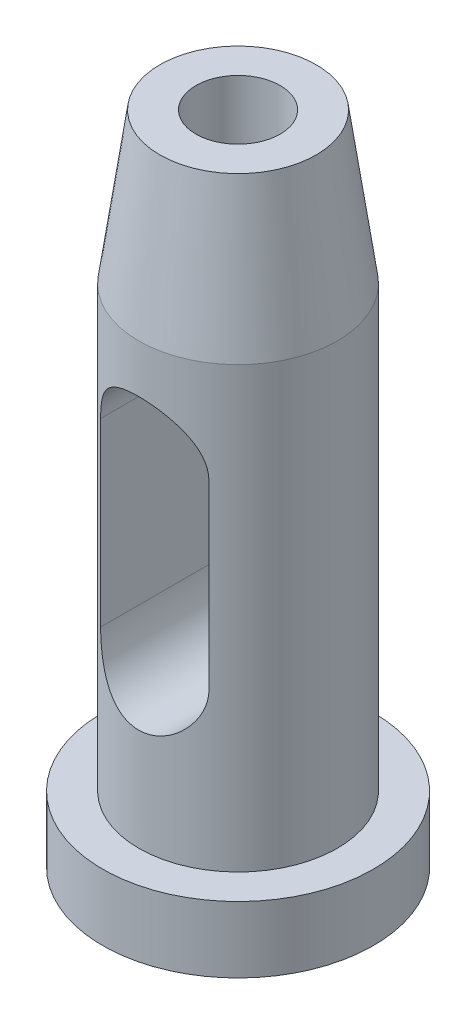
ISO-10303-21;
HEADER;
FILE_DESCRIPTION(('STEP AP214'),'2;1');
FILE_NAME('part.step','',(''),(''),'','','');
FILE_SCHEMA(('AUTOMOTIVE_DESIGN { 1 0 10303 214 1 1 1 1 }'));
ENDSEC;
DATA;
#1=APPLICATION_CONTEXT('core data for automotive mechanical design processes');
#2=APPLICATION_PROTOCOL_DEFINITION('international standard','automotive_design',2000,#1);
#3=PRODUCT_CONTEXT('',#1,'mechanical');
#4=PRODUCT('Part','Part','',(#3));
#5=PRODUCT_RELATED_PRODUCT_CATEGORY('part','',(#4));
#6=PRODUCT_DEFINITION_FORMATION('','',#4);
#7=PRODUCT_DEFINITION_CONTEXT('part definition',#1,'design');
#8=PRODUCT_DEFINITION('design','',#6,#7);
#9=PRODUCT_DEFINITION_SHAPE('','',#8);
#10=(LENGTH_UNIT() NAMED_UNIT(*) SI_UNIT(.MILLI.,.METRE.));
#11=(NAMED_UNIT(*) PLANE_ANGLE_UNIT() SI_UNIT($,.RADIAN.));
#12=(NAMED_UNIT(*) SI_UNIT($,.STERADIAN.) SOLID_ANGLE_UNIT());
#13=UNCERTAINTY_MEASURE_WITH_UNIT(LENGTH_MEASURE(1.E-05),#10,'distance_accuracy_value','');
#14=(GEOMETRIC_REPRESENTATION_CONTEXT(3) GLOBAL_UNCERTAINTY_ASSIGNED_CONTEXT((#13)) GLOBAL_UNIT_ASSIGNED_CONTEXT((#10,
#11,#12)) REPRESENTATION_CONTEXT('',''));
#15=CARTESIAN_POINT('',(0.,0.,0.));
#16=DIRECTION('',(0.,0.,1.));
#17=DIRECTION('',(1.,0.,0.));
#18=AXIS2_PLACEMENT_3D('',#15,#16,#17);
#19=CARTESIAN_POINT('',(0.,84.,0.));
#20=DIRECTION('',(0.,-1.,0.));
#21=DIRECTION('',(0.,0.,-1.));
#22=AXIS2_PLACEMENT_3D('',#19,#20,#21);
#23=CYLINDRICAL_SURFACE('',#22,22.5);
#24=CARTESIAN_POINT('',(0.,0.,0.));
#25=DIRECTION('',(0.,1.,0.));
#26=DIRECTION('',(0.,0.,1.));
#27=AXIS2_PLACEMENT_3D('',#24,#25,#26);
#28=CIRCLE('',#27,22.5);
#29=CARTESIAN_POINT('',(0.,0.,-22.5));
#30=VERTEX_POINT('',#29);
#31=EDGE_CURVE('E112',#30,#30,#28,.T.);
#32=CARTESIAN_POINT('',(0.,11.,0.));
#33=DIRECTION('',(0.,1.,0.));
#34=DIRECTION('',(0.,0.,1.));
#35=AXIS2_PLACEMENT_3D('',#32,#33,#34);
#36=CIRCLE('',#35,22.5);
#37=CARTESIAN_POINT('',(0.,11.,-22.5));
#38=VERTEX_POINT('',#37);
#39=EDGE_CURVE('E107',#38,#38,#36,.T.);
#40=CARTESIAN_POINT('',(0.,0.,-22.5));
#41=CARTESIAN_POINT('',(0.,0.114583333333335,-22.5));
#42=CARTESIAN_POINT('',(0.,0.229166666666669,-22.5));
#43=CARTESIAN_POINT('',(0.,0.458333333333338,-22.5));
#44=CARTESIAN_POINT('',(0.,0.572916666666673,-22.5));
#45=CARTESIAN_POINT('',(0.,0.802083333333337,-22.5));
#46=CARTESIAN_POINT('',(0.,0.916666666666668,-22.5));
#47=CARTESIAN_POINT('',(0.,1.14583333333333,-22.5));
#48=CARTESIAN_POINT('',(0.,1.26041666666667,-22.5));
#49=CARTESIAN_POINT('',(0.,1.48958333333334,-22.5));
#50=CARTESIAN_POINT('',(0.,1.60416666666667,-22.5));
#51=CARTESIAN_POINT('',(0.,1.83333333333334,-22.5));
#52=CARTESIAN_POINT('',(0.,1.94791666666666,-22.5));
#53=CARTESIAN_POINT('',(0.,2.17708333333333,-22.5));
#54=CARTESIAN_POINT('',(0.,2.29166666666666,-22.5));
#55=CARTESIAN_POINT('',(0.,2.52083333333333,-22.5));
#56=CARTESIAN_POINT('',(0.,2.63541666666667,-22.5));
#57=CARTESIAN_POINT('',(0.,2.86458333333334,-22.5));
#58=CARTESIAN_POINT('',(0.,2.97916666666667,-22.5));
#59=CARTESIAN_POINT('',(0.,3.20833333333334,-22.5));
#60=CARTESIAN_POINT('',(0.,3.32291666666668,-22.5));
#61=CARTESIAN_POINT('',(0.,3.55208333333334,-22.5));
#62=CARTESIAN_POINT('',(0.,3.66666666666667,-22.5));
#63=CARTESIAN_POINT('',(0.,3.89583333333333,-22.5));
#64=CARTESIAN_POINT('',(0.,4.01041666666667,-22.5));
#65=CARTESIAN_POINT('',(0.,4.23958333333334,-22.5));
#66=CARTESIAN_POINT('',(0.,4.35416666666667,-22.5));
#67=CARTESIAN_POINT('',(0.,4.58333333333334,-22.5));
#68=CARTESIAN_POINT('',(0.,4.69791666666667,-22.5));
#69=CARTESIAN_POINT('',(0.,4.92708333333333,-22.5));
#70=CARTESIAN_POINT('',(0.,5.04166666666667,-22.5));
#71=CARTESIAN_POINT('',(0.,5.27083333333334,-22.5));
#72=CARTESIAN_POINT('',(0.,5.38541666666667,-22.5));
#73=CARTESIAN_POINT('',(0.,5.61458333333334,-22.5));
#74=CARTESIAN_POINT('',(0.,5.72916666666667,-22.5));
#75=CARTESIAN_POINT('',(0.,5.95833333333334,-22.5));
#76=CARTESIAN_POINT('',(0.,6.07291666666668,-22.5));
#77=CARTESIAN_POINT('',(0.,6.30208333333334,-22.5));
#78=CARTESIAN_POINT('',(0.,6.41666666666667,-22.5));
#79=CARTESIAN_POINT('',(0.,6.64583333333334,-22.5));
#80=CARTESIAN_POINT('',(0.,6.76041666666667,-22.5));
#81=CARTESIAN_POINT('',(0.,6.98958333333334,-22.5));
#82=CARTESIAN_POINT('',(0.,7.10416666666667,-22.5));
#83=CARTESIAN_POINT('',(0.,7.33333333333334,-22.5));
#84=CARTESIAN_POINT('',(0.,7.44791666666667,-22.5));
#85=CARTESIAN_POINT('',(0.,7.67708333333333,-22.5));
#86=CARTESIAN_POINT('',(0.,7.79166666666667,-22.5));
#87=CARTESIAN_POINT('',(0.,8.02083333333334,-22.5));
#88=CARTESIAN_POINT('',(0.,8.13541666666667,-22.5));
#89=CARTESIAN_POINT('',(0.,8.36458333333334,-22.5));
#90=CARTESIAN_POINT('',(0.,8.47916666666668,-22.5));
#91=CARTESIAN_POINT('',(0.,8.70833333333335,-22.5));
#92=CARTESIAN_POINT('',(0.,8.82291666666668,-22.5));
#93=CARTESIAN_POINT('',(0.,9.05208333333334,-22.5));
#94=CARTESIAN_POINT('',(0.,9.16666666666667,-22.5));
#95=CARTESIAN_POINT('',(0.,9.39583333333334,-22.5));
#96=CARTESIAN_POINT('',(0.,9.51041666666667,-22.5));
#97=CARTESIAN_POINT('',(0.,9.73958333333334,-22.5));
#98=CARTESIAN_POINT('',(0.,9.85416666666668,-22.5));
#99=CARTESIAN_POINT('',(0.,10.0833333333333,-22.5));
#100=CARTESIAN_POINT('',(0.,10.1979166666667,-22.5));
#101=CARTESIAN_POINT('',(0.,10.4270833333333,-22.5));
#102=CARTESIAN_POINT('',(0.,10.5416666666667,-22.5));
#103=CARTESIAN_POINT('',(0.,10.7708333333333,-22.5));
#104=CARTESIAN_POINT('',(0.,10.8854166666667,-22.5));
#105=CARTESIAN_POINT('',(0.,11.,-22.5));
#106=B_SPLINE_CURVE_WITH_KNOTS('',3,(#40,#41,#42,#43,#44,#45,#46,#47,#48,#49,#50,#51,#52,#53,
#54,#55,#56,#57,#58,#59,#60,#61,#62,#63,#64,#65,#66,#67,#68,#69,#70,#71,#72,#73,#74,#75,#76,#77,
#78,#79,#80,#81,#82,#83,#84,#85,#86,#87,#88,#89,#90,#91,#92,#93,#94,#95,#96,#97,#98,#99,#100,
#101,#102,#103,#104,#105),.UNSPECIFIED.,.F.,.F.,(4,2,2,2,2,2,2,2,2,2,2,2,2,2,2,2,2,2,2,2,2,2,2,
2,2,2,2,2,2,2,2,2,4),(0.,0.343750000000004,0.687500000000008,1.03125,1.375,1.71875,
2.06249999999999,2.40625,2.75,3.09375000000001,3.43750000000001,3.78125,4.125,4.46875000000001,
4.8125,5.15625,5.50000000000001,5.84375000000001,6.18750000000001,6.53125,6.87500000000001,
7.21875000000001,7.5625,7.90625,8.25000000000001,8.59375000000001,8.93750000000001,
9.28125000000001,9.62500000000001,9.96875000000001,10.3125,10.65625,11.),.UNSPECIFIED.);
#107=EDGE_CURVE('BSEAM33',#30,#38,#106,.T.);
#108=ORIENTED_EDGE('',*,*,#31,.T.);
#109=ORIENTED_EDGE('',*,*,#39,.F.);
#110=ORIENTED_EDGE('',*,*,#107,.T.);
#111=ORIENTED_EDGE('',*,*,#107,.F.);
#112=EDGE_LOOP('',(#108,#110,#109,#111));
#113=FACE_BOUND('',#112,.T.);
#114=ADVANCED_FACE('F33',(#113),#23,.T.);
#115=CARTESIAN_POINT('',(0.,0.,0.));
#116=DIRECTION('',(0.,1.,0.));
#117=DIRECTION('',(0.,0.,1.));
#118=AXIS2_PLACEMENT_3D('',#115,#116,#117);
#119=PLANE('',#118);
#120=ORIENTED_EDGE('',*,*,#31,.F.);
#121=EDGE_LOOP('',(#120));
#122=FACE_BOUND('',#121,.T.);
#123=ADVANCED_FACE('F173',(#122),#119,.F.);
#124=CARTESIAN_POINT('',(0.,11.,0.));
#125=DIRECTION('',(0.,1.,0.));
#126=DIRECTION('',(0.,0.,1.));
#127=AXIS2_PLACEMENT_3D('',#124,#125,#126);
#128=PLANE('',#127);
#129=CARTESIAN_POINT('',(0.,11.,0.));
#130=DIRECTION('',(0.,1.,0.));
#131=DIRECTION('',(0.,0.,1.));
#132=AXIS2_PLACEMENT_3D('',#129,#130,#131);
#133=CIRCLE('',#132,16.5);
#134=CARTESIAN_POINT('',(0.,11.,16.5));
#135=VERTEX_POINT('',#134);
#136=EDGE_CURVE('E104',#135,#135,#133,.T.);
#137=ORIENTED_EDGE('',*,*,#136,.F.);
#138=EDGE_LOOP('',(#137));
#139=FACE_BOUND('',#138,.T.);
#140=ORIENTED_EDGE('',*,*,#39,.T.);
#141=EDGE_LOOP('',(#140));
#142=FACE_BOUND('',#141,.T.);
#143=ADVANCED_FACE('F171',(#139,#142),#128,.T.);
#144=CARTESIAN_POINT('',(0.,11.,0.));
#145=DIRECTION('',(0.,1.,0.));
#146=DIRECTION('',(0.,0.,1.));
#147=AXIS2_PLACEMENT_3D('',#144,#145,#146);
#148=CYLINDRICAL_SURFACE('',#147,16.5);
#149=CARTESIAN_POINT('',(9.,37.,-13.8293166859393));
#150=CARTESIAN_POINT('',(9.00000108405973,36.883879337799,-13.8293134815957));
#151=CARTESIAN_POINT('',(8.99775214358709,36.767775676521,-13.8307798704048));
#152=CARTESIAN_POINT('',(8.98877121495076,36.535821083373,-13.8366193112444));
#153=CARTESIAN_POINT('',(8.98203946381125,36.4199701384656,-13.8409922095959));
#154=CARTESIAN_POINT('',(8.95516299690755,36.0733363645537,-13.8584105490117));
#155=CARTESIAN_POINT('',(8.92833699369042,35.8432404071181,-13.8757557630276));
#156=CARTESIAN_POINT('',(8.85750818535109,35.3884183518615,-13.9210734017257));
#157=CARTESIAN_POINT('',(8.8136216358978,35.1636666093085,-13.948973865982));
#158=CARTESIAN_POINT('',(8.70925748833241,34.7194526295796,-14.0143719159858));
#159=CARTESIAN_POINT('',(8.64877742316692,34.4999911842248,-14.051870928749));
#160=CARTESIAN_POINT('',(8.51214530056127,34.0683671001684,-14.1350539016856));
#161=CARTESIAN_POINT('',(8.43604118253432,33.8561843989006,-14.1807127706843));
#162=CARTESIAN_POINT('',(8.26878667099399,33.4394344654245,-14.2788853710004));
#163=CARTESIAN_POINT('',(8.17763046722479,33.2348702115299,-14.3314017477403));
#164=CARTESIAN_POINT('',(7.88243166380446,32.6334424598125,-14.4971809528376));
#165=CARTESIAN_POINT('',(7.65678284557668,32.2492309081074,-14.6185947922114));
#166=CARTESIAN_POINT('',(7.12849041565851,31.4844351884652,-14.8838866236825));
#167=CARTESIAN_POINT('',(6.82045172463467,31.107936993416,-15.0287993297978));
#168=CARTESIAN_POINT('',(6.31599281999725,30.5838378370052,-15.2444045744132));
#169=CARTESIAN_POINT('',(6.1406750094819,30.4158391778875,-15.3160142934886));
#170=CARTESIAN_POINT('',(5.77646350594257,30.0940974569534,-15.4570552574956));
#171=CARTESIAN_POINT('',(5.58756768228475,29.9403566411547,-15.5264861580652));
#172=CARTESIAN_POINT('',(5.18051796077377,29.6357479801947,-15.6672413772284));
#173=CARTESIAN_POINT('',(4.96124072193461,29.4862228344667,-15.7382291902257));
#174=CARTESIAN_POINT('',(4.50895648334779,29.2064140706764,-15.8737205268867));
#175=CARTESIAN_POINT('',(4.27595550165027,29.0761221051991,-15.9382268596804));
#176=CARTESIAN_POINT('',(3.79761413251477,28.8360727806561,-16.058921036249));
#177=CARTESIAN_POINT('',(3.55227747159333,28.726309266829,-16.1151113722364));
#178=CARTESIAN_POINT('',(3.05094857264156,28.5286196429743,-16.2174945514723));
#179=CARTESIAN_POINT('',(2.79495773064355,28.4406906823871,-16.2636886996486));
#180=CARTESIAN_POINT('',(2.29578601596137,28.2941761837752,-16.3412924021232));
#181=CARTESIAN_POINT('',(2.05327784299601,28.2337747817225,-16.3736041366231));
#182=CARTESIAN_POINT('',(1.56293437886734,28.1332161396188,-16.4276612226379));
#183=CARTESIAN_POINT('',(1.31509935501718,28.0930578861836,-16.4494071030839));
#184=CARTESIAN_POINT('',(0.816366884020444,28.0335861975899,-16.4816853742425));
#185=CARTESIAN_POINT('',(0.565471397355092,28.0142600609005,-16.4922245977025));
#186=CARTESIAN_POINT('',(0.0627317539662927,27.9967054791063,-16.5017954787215));
#187=CARTESIAN_POINT('',(-0.189112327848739,27.9984754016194,-16.50082802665));
#188=CARTESIAN_POINT('',(-0.665502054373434,28.0218053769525,-16.4881140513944));
#189=CARTESIAN_POINT('',(-0.890182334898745,28.0413039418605,-16.4774903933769));
#190=CARTESIAN_POINT('',(-1.33685629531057,28.0969968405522,-16.4472768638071));
#191=CARTESIAN_POINT('',(-1.55884996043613,28.1331912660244,-16.4276869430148));
#192=CARTESIAN_POINT('',(-1.99861633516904,28.2218538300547,-16.380001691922));
#193=CARTESIAN_POINT('',(-2.21638915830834,28.274321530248,-16.3519065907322));
#194=CARTESIAN_POINT('',(-2.64635039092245,28.3949611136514,-16.287850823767));
#195=CARTESIAN_POINT('',(-2.85853858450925,28.4631336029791,-16.2518898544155));
#196=CARTESIAN_POINT('',(-3.27839087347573,28.6153386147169,-16.1724544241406));
#197=CARTESIAN_POINT('',(-3.48598071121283,28.6995354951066,-16.1289025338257));
#198=CARTESIAN_POINT('',(-3.89317238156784,28.882544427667,-16.0354892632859));
#199=CARTESIAN_POINT('',(-4.09277155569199,28.9813612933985,-15.9856258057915));
#200=CARTESIAN_POINT('',(-4.6780854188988,29.2985524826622,-15.8280900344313));
#201=CARTESIAN_POINT('',(-5.05057142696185,29.5377607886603,-15.7124221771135));
#202=CARTESIAN_POINT('',(-5.79155336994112,30.0938519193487,-15.4556692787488));
#203=CARTESIAN_POINT('',(-6.15539162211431,30.416296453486,-15.3131891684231));
#204=CARTESIAN_POINT('',(-6.65848604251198,30.9400196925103,-15.0979492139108));
#205=CARTESIAN_POINT('',(-6.81920359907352,31.1214581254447,-15.0258813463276));
#206=CARTESIAN_POINT('',(-7.12576361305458,31.4970705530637,-14.8829449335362));
#207=CARTESIAN_POINT('',(-7.27160350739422,31.6912467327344,-14.8120765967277));
#208=CARTESIAN_POINT('',(-7.55952537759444,32.1088482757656,-14.667370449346));
#209=CARTESIAN_POINT('',(-7.70018681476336,32.3333501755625,-14.593807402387));
#210=CARTESIAN_POINT('',(-7.96181155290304,32.7952459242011,-14.4527381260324));
#211=CARTESIAN_POINT('',(-8.08278383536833,33.0326338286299,-14.3852291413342));
#212=CARTESIAN_POINT('',(-8.3036590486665,33.5185749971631,-14.2588712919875));
#213=CARTESIAN_POINT('',(-8.40360853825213,33.76710207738,-14.2000033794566));
#214=CARTESIAN_POINT('',(-8.58148374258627,34.2741530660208,-14.0932226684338));
#215=CARTESIAN_POINT('',(-8.65941860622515,34.5326727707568,-14.0453053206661));
#216=CARTESIAN_POINT('',(-8.7708010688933,34.9734488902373,-13.9759024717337));
#217=CARTESIAN_POINT('',(-8.81050140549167,35.1535934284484,-13.9508676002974));
#218=CARTESIAN_POINT('',(-8.87885237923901,35.5167275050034,-13.9074662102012));
#219=CARTESIAN_POINT('',(-8.90750616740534,35.6997162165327,-13.8890977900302));
#220=CARTESIAN_POINT('',(-8.95358220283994,36.0683513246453,-13.8594431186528));
#221=CARTESIAN_POINT('',(-8.97096345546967,36.2540049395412,-13.8481827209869));
#222=CARTESIAN_POINT('',(-8.99418564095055,36.6264335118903,-13.8331000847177));
#223=CARTESIAN_POINT('',(-9.00002022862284,36.8132090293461,-13.8292819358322));
#224=CARTESIAN_POINT('',(-9.,37.,-13.8293166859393));
#225=B_SPLINE_CURVE_WITH_KNOTS('',3,(#149,#150,#151,#152,#153,#154,#155,#156,#157,#158,#159,
#160,#161,#162,#163,#164,#165,#166,#167,#168,#169,#170,#171,#172,#173,#174,#175,#176,#177,#178,
#179,#180,#181,#182,#183,#184,#185,#186,#187,#188,#189,#190,#191,#192,#193,#194,#195,#196,#197,
#198,#199,#200,#201,#202,#203,#204,#205,#206,#207,#208,#209,#210,#211,#212,#213,#214,#215,#216,
#217,#218,#219,#220,#221,#222,#223,#224),.UNSPECIFIED.,.F.,.F.,(4,2,2,2,2,2,2,2,2,2,2,2,2,2,2,2,
2,2,2,2,2,2,2,2,2,2,2,2,2,2,2,2,2,2,2,2,2,4),(0.,0.348297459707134,0.696576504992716,
1.3924406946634,2.08364390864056,2.77494994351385,3.46416571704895,4.15364815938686,
5.53384137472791,7.05000030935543,7.80883706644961,8.56779315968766,9.39093850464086,
10.2137255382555,11.0362654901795,11.8586980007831,12.6136393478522,13.3685428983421,
14.1229859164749,14.8773705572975,15.5538916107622,16.2304163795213,16.9069229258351,
17.5834555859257,18.2673428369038,18.9514557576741,20.3188620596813,21.8320268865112,
22.5900243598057,23.348152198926,24.1719696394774,24.9954102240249,25.8170074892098,
26.6382628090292,27.1963145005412,27.7542068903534,28.3141169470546,28.8743346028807),.UNSPECIFIED.);
#226=CARTESIAN_POINT('',(9.,37.,-13.8293166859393));
#227=VERTEX_POINT('',#226);
#228=CARTESIAN_POINT('',(-9.,37.,-13.8293166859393));
#229=VERTEX_POINT('',#228);
#230=EDGE_CURVE('E11',#227,#229,#225,.T.);
#231=ORIENTED_EDGE('',*,*,#230,.F.);
#232=DIRECTION('',(0.,1.,0.));
#233=VECTOR('',#232,1.);
#234=CARTESIAN_POINT('',(9.,11.,-13.8293166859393));
#235=LINE('',#234,#233);
#236=CARTESIAN_POINT('',(9.,67.,-13.8293166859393));
#237=VERTEX_POINT('',#236);
#238=EDGE_CURVE('E144',#237,#227,#235,.F.);
#239=ORIENTED_EDGE('',*,*,#238,.F.);
#240=CARTESIAN_POINT('',(-9.,67.,-13.8293166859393));
#241=CARTESIAN_POINT('',(-9.00000108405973,67.116120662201,-13.8293134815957));
#242=CARTESIAN_POINT('',(-8.99775214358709,67.232224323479,-13.8307798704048));
#243=CARTESIAN_POINT('',(-8.98877121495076,67.464178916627,-13.8366193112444));
#244=CARTESIAN_POINT('',(-8.98203946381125,67.5800298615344,-13.8409922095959));
#245=CARTESIAN_POINT('',(-8.95516299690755,67.9266636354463,-13.8584105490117));
#246=CARTESIAN_POINT('',(-8.92833699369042,68.1567595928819,-13.8757557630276));
#247=CARTESIAN_POINT('',(-8.85750818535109,68.6115816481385,-13.9210734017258));
#248=CARTESIAN_POINT('',(-8.8136216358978,68.8363333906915,-13.948973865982));
#249=CARTESIAN_POINT('',(-8.70925748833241,69.2805473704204,-14.0143719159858));
#250=CARTESIAN_POINT('',(-8.64877742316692,69.5000088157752,-14.051870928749));
#251=CARTESIAN_POINT('',(-8.51214530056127,69.9316328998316,-14.1350539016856));
#252=CARTESIAN_POINT('',(-8.43604118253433,70.1438156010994,-14.1807127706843));
#253=CARTESIAN_POINT('',(-8.268786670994,70.5605655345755,-14.2788853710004));
#254=CARTESIAN_POINT('',(-8.1776304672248,70.7651297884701,-14.3314017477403));
#255=CARTESIAN_POINT('',(-7.88243166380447,71.3665575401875,-14.4971809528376));
#256=CARTESIAN_POINT('',(-7.65678284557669,71.7507690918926,-14.6185947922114));
#257=CARTESIAN_POINT('',(-7.12849041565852,72.5155648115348,-14.8838866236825));
#258=CARTESIAN_POINT('',(-6.82045172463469,72.892063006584,-15.0287993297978));
#259=CARTESIAN_POINT('',(-6.31599281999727,73.4161621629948,-15.2444045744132));
#260=CARTESIAN_POINT('',(-6.14067500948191,73.5841608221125,-15.3160142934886));
#261=CARTESIAN_POINT('',(-5.77646350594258,73.9059025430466,-15.4570552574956));
#262=CARTESIAN_POINT('',(-5.58756768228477,74.0596433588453,-15.5264861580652));
#263=CARTESIAN_POINT('',(-5.18051796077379,74.3642520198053,-15.6672413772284));
#264=CARTESIAN_POINT('',(-4.96124072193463,74.5137771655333,-15.7382291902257));
#265=CARTESIAN_POINT('',(-4.50895648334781,74.7935859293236,-15.8737205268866));
#266=CARTESIAN_POINT('',(-4.27595550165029,74.9238778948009,-15.9382268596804));
#267=CARTESIAN_POINT('',(-3.79761413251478,75.1639272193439,-16.058921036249));
#268=CARTESIAN_POINT('',(-3.55227747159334,75.273690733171,-16.1151113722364));
#269=CARTESIAN_POINT('',(-3.05094857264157,75.4713803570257,-16.2174945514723));
#270=CARTESIAN_POINT('',(-2.79495773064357,75.5593093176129,-16.2636886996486));
#271=CARTESIAN_POINT('',(-2.29578601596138,75.7058238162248,-16.3412924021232));
#272=CARTESIAN_POINT('',(-2.05327784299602,75.7662252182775,-16.3736041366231));
#273=CARTESIAN_POINT('',(-1.56293437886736,75.8667838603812,-16.4276612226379));
#274=CARTESIAN_POINT('',(-1.3150993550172,75.9069421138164,-16.4494071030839));
#275=CARTESIAN_POINT('',(-0.816366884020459,75.9664138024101,-16.4816853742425));
#276=CARTESIAN_POINT('',(-0.565471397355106,75.9857399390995,-16.4922245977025));
#277=CARTESIAN_POINT('',(-0.0627317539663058,76.0032945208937,-16.5017954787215));
#278=CARTESIAN_POINT('',(0.189112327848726,76.0015245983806,-16.50082802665));
#279=CARTESIAN_POINT('',(0.665502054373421,75.9781946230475,-16.4881140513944));
#280=CARTESIAN_POINT('',(0.890182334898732,75.9586960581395,-16.4774903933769));
#281=CARTESIAN_POINT('',(1.33685629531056,75.9030031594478,-16.4472768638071));
#282=CARTESIAN_POINT('',(1.55884996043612,75.8668087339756,-16.4276869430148));
#283=CARTESIAN_POINT('',(1.99861633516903,75.7781461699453,-16.380001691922));
#284=CARTESIAN_POINT('',(2.21638915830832,75.725678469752,-16.3519065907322));
#285=CARTESIAN_POINT('',(2.64635039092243,75.6050388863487,-16.287850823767));
#286=CARTESIAN_POINT('',(2.85853858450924,75.5368663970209,-16.2518898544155));
#287=CARTESIAN_POINT('',(3.27839087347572,75.3846613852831,-16.1724544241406));
#288=CARTESIAN_POINT('',(3.48598071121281,75.3004645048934,-16.1289025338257));
#289=CARTESIAN_POINT('',(3.89317238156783,75.117455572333,-16.0354892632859));
#290=CARTESIAN_POINT('',(4.09277155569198,75.0186387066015,-15.9856258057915));
#291=CARTESIAN_POINT('',(4.67808541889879,74.7014475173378,-15.8280900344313));
#292=CARTESIAN_POINT('',(5.05057142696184,74.4622392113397,-15.7124221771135));
#293=CARTESIAN_POINT('',(5.7915533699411,73.9061480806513,-15.4556692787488));
#294=CARTESIAN_POINT('',(6.1553916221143,73.5837035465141,-15.3131891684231));
#295=CARTESIAN_POINT('',(6.65848604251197,73.0599803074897,-15.0979492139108));
#296=CARTESIAN_POINT('',(6.81920359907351,72.8785418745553,-15.0258813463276));
#297=CARTESIAN_POINT('',(7.12576361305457,72.5029294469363,-14.8829449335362));
#298=CARTESIAN_POINT('',(7.27160350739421,72.3087532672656,-14.8120765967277));
#299=CARTESIAN_POINT('',(7.55952537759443,71.8911517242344,-14.667370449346));
#300=CARTESIAN_POINT('',(7.70018681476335,71.6666498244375,-14.593807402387));
#301=CARTESIAN_POINT('',(7.96181155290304,71.2047540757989,-14.4527381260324));
#302=CARTESIAN_POINT('',(8.08278383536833,70.9673661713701,-14.3852291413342));
#303=CARTESIAN_POINT('',(8.30365904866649,70.4814250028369,-14.2588712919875));
#304=CARTESIAN_POINT('',(8.40360853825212,70.23289792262,-14.2000033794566));
#305=CARTESIAN_POINT('',(8.58148374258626,69.7258469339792,-14.0932226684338));
#306=CARTESIAN_POINT('',(8.65941860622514,69.4673272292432,-14.0453053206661));
#307=CARTESIAN_POINT('',(8.7708010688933,69.0265511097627,-13.9759024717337));
#308=CARTESIAN_POINT('',(8.81050140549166,68.8464065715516,-13.9508676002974));
#309=CARTESIAN_POINT('',(8.87885237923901,68.4832724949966,-13.9074662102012));
#310=CARTESIAN_POINT('',(8.90750616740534,68.3002837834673,-13.8890977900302));
#311=CARTESIAN_POINT('',(8.95358220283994,67.9316486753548,-13.8594431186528));
#312=CARTESIAN_POINT('',(8.97096345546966,67.7459950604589,-13.8481827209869));
#313=CARTESIAN_POINT('',(8.99418564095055,67.3735664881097,-13.8331000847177));
#314=CARTESIAN_POINT('',(9.00002022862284,67.186790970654,-13.8292819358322));
#315=CARTESIAN_POINT('',(9.,67.,-13.8293166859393));
#316=B_SPLINE_CURVE_WITH_KNOTS('',3,(#240,#241,#242,#243,#244,#245,#246,#247,#248,#249,#250,
#251,#252,#253,#254,#255,#256,#257,#258,#259,#260,#261,#262,#263,#264,#265,#266,#267,#268,#269,
#270,#271,#272,#273,#274,#275,#276,#277,#278,#279,#280,#281,#282,#283,#284,#285,#286,#287,#288,
#289,#290,#291,#292,#293,#294,#295,#296,#297,#298,#299,#300,#301,#302,#303,#304,#305,#306,#307,
#308,#309,#310,#311,#312,#313,#314,#315),.UNSPECIFIED.,.F.,.F.,(4,2,2,2,2,2,2,2,2,2,2,2,2,2,2,2,
2,2,2,2,2,2,2,2,2,2,2,2,2,2,2,2,2,2,2,2,2,4),(0.,0.348297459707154,0.696576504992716,
1.3924406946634,2.08364390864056,2.77494994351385,3.46416571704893,4.15364815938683,
5.53384137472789,7.05000030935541,7.80883706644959,8.56779315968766,9.39093850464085,
10.2137255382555,11.0362654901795,11.8586980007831,12.6136393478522,13.3685428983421,
14.1229859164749,14.8773705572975,15.5538916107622,16.2304163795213,16.9069229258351,
17.5834555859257,18.2673428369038,18.951455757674,20.3188620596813,21.8320268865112,
22.5900243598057,23.348152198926,24.1719696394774,24.9954102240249,25.8170074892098,
26.6382628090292,27.1963145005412,27.7542068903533,28.3141169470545,28.8743346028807),.UNSPECIFIED.);
#317=CARTESIAN_POINT('',(-9.,67.,-13.8293166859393));
#318=VERTEX_POINT('',#317);
#319=EDGE_CURVE('E139',#318,#237,#316,.T.);
#320=ORIENTED_EDGE('',*,*,#319,.F.);
#321=DIRECTION('',(0.,1.,0.));
#322=VECTOR('',#321,1.);
#323=CARTESIAN_POINT('',(-9.,11.,-13.8293166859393));
#324=LINE('',#323,#322);
#325=EDGE_CURVE('E45',#229,#318,#324,.T.);
#326=ORIENTED_EDGE('',*,*,#325,.F.);
#327=EDGE_LOOP('',(#231,#239,#320,#326));
#328=FACE_BOUND('',#327,.T.);
#329=CARTESIAN_POINT('',(-9.,37.,13.8293166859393));
#330=CARTESIAN_POINT('',(-9.00000108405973,36.883879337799,13.8293134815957));
#331=CARTESIAN_POINT('',(-8.99775214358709,36.767775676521,13.8307798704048));
#332=CARTESIAN_POINT('',(-8.98877121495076,36.535821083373,13.8366193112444));
#333=CARTESIAN_POINT('',(-8.98203946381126,36.4199701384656,13.8409922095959));
#334=CARTESIAN_POINT('',(-8.95516299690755,36.0733363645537,13.8584105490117));
#335=CARTESIAN_POINT('',(-8.92833699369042,35.8432404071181,13.8757557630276));
#336=CARTESIAN_POINT('',(-8.85750818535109,35.3884183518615,13.9210734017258));
#337=CARTESIAN_POINT('',(-8.81362163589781,35.1636666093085,13.948973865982));
#338=CARTESIAN_POINT('',(-8.70925748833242,34.7194526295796,14.0143719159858));
#339=CARTESIAN_POINT('',(-8.64877742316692,34.4999911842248,14.051870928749));
#340=CARTESIAN_POINT('',(-8.51214530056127,34.0683671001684,14.1350539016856));
#341=CARTESIAN_POINT('',(-8.43604118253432,33.8561843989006,14.1807127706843));
#342=CARTESIAN_POINT('',(-8.26878667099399,33.4394344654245,14.2788853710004));
#343=CARTESIAN_POINT('',(-8.17763046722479,33.2348702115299,14.3314017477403));
#344=CARTESIAN_POINT('',(-7.88243166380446,32.6334424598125,14.4971809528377));
#345=CARTESIAN_POINT('',(-7.65678284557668,32.2492309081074,14.6185947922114));
#346=CARTESIAN_POINT('',(-7.12849041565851,31.4844351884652,14.8838866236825));
#347=CARTESIAN_POINT('',(-6.82045172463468,31.107936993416,15.0287993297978));
#348=CARTESIAN_POINT('',(-6.31599281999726,30.5838378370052,15.2444045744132));
#349=CARTESIAN_POINT('',(-6.1406750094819,30.4158391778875,15.3160142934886));
#350=CARTESIAN_POINT('',(-5.77646350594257,30.0940974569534,15.4570552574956));
#351=CARTESIAN_POINT('',(-5.58756768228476,29.9403566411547,15.5264861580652));
#352=CARTESIAN_POINT('',(-5.18051796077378,29.6357479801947,15.6672413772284));
#353=CARTESIAN_POINT('',(-4.96124072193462,29.4862228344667,15.7382291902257));
#354=CARTESIAN_POINT('',(-4.5089564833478,29.2064140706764,15.8737205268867));
#355=CARTESIAN_POINT('',(-4.27595550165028,29.0761221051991,15.9382268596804));
#356=CARTESIAN_POINT('',(-3.79761413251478,28.8360727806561,16.058921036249));
#357=CARTESIAN_POINT('',(-3.55227747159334,28.726309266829,16.1151113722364));
#358=CARTESIAN_POINT('',(-3.05094857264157,28.5286196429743,16.2174945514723));
#359=CARTESIAN_POINT('',(-2.79495773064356,28.4406906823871,16.2636886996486));
#360=CARTESIAN_POINT('',(-2.29578601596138,28.2941761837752,16.3412924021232));
#361=CARTESIAN_POINT('',(-2.05327784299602,28.2337747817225,16.3736041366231));
#362=CARTESIAN_POINT('',(-1.56293437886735,28.1332161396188,16.4276612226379));
#363=CARTESIAN_POINT('',(-1.31509935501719,28.0930578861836,16.4494071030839));
#364=CARTESIAN_POINT('',(-0.816366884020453,28.0335861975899,16.4816853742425));
#365=CARTESIAN_POINT('',(-0.5654713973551,28.0142600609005,16.4922245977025));
#366=CARTESIAN_POINT('',(-0.0627317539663,27.9967054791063,16.5017954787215));
#367=CARTESIAN_POINT('',(0.189112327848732,27.9984754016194,16.50082802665));
#368=CARTESIAN_POINT('',(0.665502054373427,28.0218053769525,16.4881140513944));
#369=CARTESIAN_POINT('',(0.890182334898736,28.0413039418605,16.4774903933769));
#370=CARTESIAN_POINT('',(1.33685629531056,28.0969968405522,16.4472768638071));
#371=CARTESIAN_POINT('',(1.55884996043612,28.1331912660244,16.4276869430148));
#372=CARTESIAN_POINT('',(1.99861633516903,28.2218538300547,16.380001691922));
#373=CARTESIAN_POINT('',(2.21638915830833,28.274321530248,16.3519065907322));
#374=CARTESIAN_POINT('',(2.64635039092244,28.3949611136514,16.287850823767));
#375=CARTESIAN_POINT('',(2.85853858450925,28.4631336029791,16.2518898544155));
#376=CARTESIAN_POINT('',(3.27839087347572,28.6153386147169,16.1724544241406));
#377=CARTESIAN_POINT('',(3.48598071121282,28.6995354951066,16.1289025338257));
#378=CARTESIAN_POINT('',(3.89317238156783,28.882544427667,16.0354892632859));
#379=CARTESIAN_POINT('',(4.09277155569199,28.9813612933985,15.9856258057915));
#380=CARTESIAN_POINT('',(4.6780854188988,29.2985524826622,15.8280900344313));
#381=CARTESIAN_POINT('',(5.05057142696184,29.5377607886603,15.7124221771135));
#382=CARTESIAN_POINT('',(5.79155336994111,30.0938519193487,15.4556692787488));
#383=CARTESIAN_POINT('',(6.15539162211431,30.416296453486,15.3131891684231));
#384=CARTESIAN_POINT('',(6.65848604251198,30.9400196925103,15.0979492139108));
#385=CARTESIAN_POINT('',(6.81920359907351,31.1214581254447,15.0258813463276));
#386=CARTESIAN_POINT('',(7.12576361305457,31.4970705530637,14.8829449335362));
#387=CARTESIAN_POINT('',(7.27160350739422,31.6912467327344,14.8120765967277));
#388=CARTESIAN_POINT('',(7.55952537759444,32.1088482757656,14.667370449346));
#389=CARTESIAN_POINT('',(7.70018681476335,32.3333501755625,14.593807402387));
#390=CARTESIAN_POINT('',(7.96181155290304,32.7952459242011,14.4527381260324));
#391=CARTESIAN_POINT('',(8.08278383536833,33.0326338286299,14.3852291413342));
#392=CARTESIAN_POINT('',(8.3036590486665,33.5185749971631,14.2588712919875));
#393=CARTESIAN_POINT('',(8.40360853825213,33.76710207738,14.2000033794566));
#394=CARTESIAN_POINT('',(8.58148374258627,34.2741530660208,14.0932226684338));
#395=CARTESIAN_POINT('',(8.65941860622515,34.5326727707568,14.0453053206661));
#396=CARTESIAN_POINT('',(8.7708010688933,34.9734488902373,13.9759024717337));
#397=CARTESIAN_POINT('',(8.81050140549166,35.1535934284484,13.9508676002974));
#398=CARTESIAN_POINT('',(8.87885237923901,35.5167275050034,13.9074662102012));
#399=CARTESIAN_POINT('',(8.90750616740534,35.6997162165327,13.8890977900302));
#400=CARTESIAN_POINT('',(8.95358220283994,36.0683513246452,13.8594431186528));
#401=CARTESIAN_POINT('',(8.97096345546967,36.2540049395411,13.8481827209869));
#402=CARTESIAN_POINT('',(8.99418564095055,36.6264335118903,13.8331000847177));
#403=CARTESIAN_POINT('',(9.00002022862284,36.8132090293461,13.8292819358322));
#404=CARTESIAN_POINT('',(9.,37.,13.8293166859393));
#405=B_SPLINE_CURVE_WITH_KNOTS('',3,(#329,#330,#331,#332,#333,#334,#335,#336,#337,#338,#339,
#340,#341,#342,#343,#344,#345,#346,#347,#348,#349,#350,#351,#352,#353,#354,#355,#356,#357,#358,
#359,#360,#361,#362,#363,#364,#365,#366,#367,#368,#369,#370,#371,#372,#373,#374,#375,#376,#377,
#378,#379,#380,#381,#382,#383,#384,#385,#386,#387,#388,#389,#390,#391,#392,#393,#394,#395,#396,
#397,#398,#399,#400,#401,#402,#403,#404),.UNSPECIFIED.,.F.,.F.,(4,2,2,2,2,2,2,2,2,2,2,2,2,2,2,2,
2,2,2,2,2,2,2,2,2,2,2,2,2,2,2,2,2,2,2,2,2,4),(0.,0.348297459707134,0.696576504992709,
1.39244069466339,2.08364390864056,2.77494994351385,3.46416571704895,4.15364815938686,
5.53384137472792,7.05000030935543,7.80883706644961,8.56779315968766,9.39093850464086,
10.2137255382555,11.0362654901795,11.8586980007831,12.6136393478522,13.3685428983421,
14.1229859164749,14.8773705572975,15.5538916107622,16.2304163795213,16.9069229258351,
17.5834555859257,18.2673428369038,18.9514557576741,20.3188620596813,21.8320268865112,
22.5900243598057,23.348152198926,24.1719696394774,24.9954102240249,25.8170074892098,
26.6382628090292,27.1963145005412,27.7542068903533,28.3141169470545,28.8743346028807),.UNSPECIFIED.);
#406=CARTESIAN_POINT('',(-9.,37.,13.8293166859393));
#407=VERTEX_POINT('',#406);
#408=CARTESIAN_POINT('',(9.,37.,13.8293166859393));
#409=VERTEX_POINT('',#408);
#410=EDGE_CURVE('E156',#407,#409,#405,.T.);
#411=ORIENTED_EDGE('',*,*,#410,.F.);
#412=DIRECTION('',(0.,1.,0.));
#413=VECTOR('',#412,1.);
#414=CARTESIAN_POINT('',(-9.,11.,13.8293166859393));
#415=LINE('',#414,#413);
#416=CARTESIAN_POINT('',(-9.,67.,13.8293166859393));
#417=VERTEX_POINT('',#416);
#418=EDGE_CURVE('E123',#417,#407,#415,.F.);
#419=ORIENTED_EDGE('',*,*,#418,.F.);
#420=CARTESIAN_POINT('',(9.,67.,13.8293166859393));
#421=CARTESIAN_POINT('',(9.00000108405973,67.116120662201,13.8293134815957));
#422=CARTESIAN_POINT('',(8.99775214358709,67.232224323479,13.8307798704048));
#423=CARTESIAN_POINT('',(8.98877121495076,67.464178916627,13.8366193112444));
#424=CARTESIAN_POINT('',(8.98203946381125,67.5800298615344,13.8409922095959));
#425=CARTESIAN_POINT('',(8.95516299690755,67.9266636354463,13.8584105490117));
#426=CARTESIAN_POINT('',(8.92833699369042,68.1567595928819,13.8757557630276));
#427=CARTESIAN_POINT('',(8.85750818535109,68.6115816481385,13.9210734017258));
#428=CARTESIAN_POINT('',(8.8136216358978,68.8363333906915,13.948973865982));
#429=CARTESIAN_POINT('',(8.70925748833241,69.2805473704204,14.0143719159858));
#430=CARTESIAN_POINT('',(8.64877742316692,69.5000088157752,14.051870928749));
#431=CARTESIAN_POINT('',(8.51214530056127,69.9316328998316,14.1350539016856));
#432=CARTESIAN_POINT('',(8.43604118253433,70.1438156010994,14.1807127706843));
#433=CARTESIAN_POINT('',(8.268786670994,70.5605655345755,14.2788853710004));
#434=CARTESIAN_POINT('',(8.1776304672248,70.7651297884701,14.3314017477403));
#435=CARTESIAN_POINT('',(7.88243166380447,71.3665575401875,14.4971809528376));
#436=CARTESIAN_POINT('',(7.65678284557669,71.7507690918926,14.6185947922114));
#437=CARTESIAN_POINT('',(7.12849041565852,72.5155648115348,14.8838866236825));
#438=CARTESIAN_POINT('',(6.82045172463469,72.892063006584,15.0287993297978));
#439=CARTESIAN_POINT('',(6.31599281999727,73.4161621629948,15.2444045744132));
#440=CARTESIAN_POINT('',(6.14067500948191,73.5841608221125,15.3160142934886));
#441=CARTESIAN_POINT('',(5.77646350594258,73.9059025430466,15.4570552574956));
#442=CARTESIAN_POINT('',(5.58756768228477,74.0596433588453,15.5264861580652));
#443=CARTESIAN_POINT('',(5.18051796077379,74.3642520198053,15.6672413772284));
#444=CARTESIAN_POINT('',(4.96124072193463,74.5137771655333,15.7382291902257));
#445=CARTESIAN_POINT('',(4.50895648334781,74.7935859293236,15.8737205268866));
#446=CARTESIAN_POINT('',(4.27595550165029,74.9238778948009,15.9382268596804));
#447=CARTESIAN_POINT('',(3.79761413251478,75.1639272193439,16.058921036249));
#448=CARTESIAN_POINT('',(3.55227747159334,75.273690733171,16.1151113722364));
#449=CARTESIAN_POINT('',(3.05094857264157,75.4713803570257,16.2174945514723));
#450=CARTESIAN_POINT('',(2.79495773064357,75.5593093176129,16.2636886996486));
#451=CARTESIAN_POINT('',(2.29578601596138,75.7058238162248,16.3412924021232));
#452=CARTESIAN_POINT('',(2.05327784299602,75.7662252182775,16.3736041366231));
#453=CARTESIAN_POINT('',(1.56293437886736,75.8667838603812,16.4276612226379));
#454=CARTESIAN_POINT('',(1.3150993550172,75.9069421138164,16.4494071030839));
#455=CARTESIAN_POINT('',(0.816366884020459,75.9664138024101,16.4816853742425));
#456=CARTESIAN_POINT('',(0.565471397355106,75.9857399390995,16.4922245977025));
#457=CARTESIAN_POINT('',(0.0627317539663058,76.0032945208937,16.5017954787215));
#458=CARTESIAN_POINT('',(-0.189112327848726,76.0015245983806,16.50082802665));
#459=CARTESIAN_POINT('',(-0.665502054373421,75.9781946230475,16.4881140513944));
#460=CARTESIAN_POINT('',(-0.890182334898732,75.9586960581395,16.4774903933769));
#461=CARTESIAN_POINT('',(-1.33685629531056,75.9030031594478,16.4472768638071));
#462=CARTESIAN_POINT('',(-1.55884996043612,75.8668087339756,16.4276869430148));
#463=CARTESIAN_POINT('',(-1.99861633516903,75.7781461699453,16.380001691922));
#464=CARTESIAN_POINT('',(-2.21638915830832,75.725678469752,16.3519065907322));
#465=CARTESIAN_POINT('',(-2.64635039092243,75.6050388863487,16.287850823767));
#466=CARTESIAN_POINT('',(-2.85853858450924,75.5368663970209,16.2518898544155));
#467=CARTESIAN_POINT('',(-3.27839087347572,75.3846613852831,16.1724544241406));
#468=CARTESIAN_POINT('',(-3.48598071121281,75.3004645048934,16.1289025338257));
#469=CARTESIAN_POINT('',(-3.89317238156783,75.117455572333,16.0354892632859));
#470=CARTESIAN_POINT('',(-4.09277155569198,75.0186387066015,15.9856258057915));
#471=CARTESIAN_POINT('',(-4.67808541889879,74.7014475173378,15.8280900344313));
#472=CARTESIAN_POINT('',(-5.05057142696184,74.4622392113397,15.7124221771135));
#473=CARTESIAN_POINT('',(-5.7915533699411,73.9061480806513,15.4556692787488));
#474=CARTESIAN_POINT('',(-6.1553916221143,73.5837035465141,15.3131891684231));
#475=CARTESIAN_POINT('',(-6.65848604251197,73.0599803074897,15.0979492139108));
#476=CARTESIAN_POINT('',(-6.81920359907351,72.8785418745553,15.0258813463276));
#477=CARTESIAN_POINT('',(-7.12576361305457,72.5029294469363,14.8829449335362));
#478=CARTESIAN_POINT('',(-7.27160350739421,72.3087532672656,14.8120765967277));
#479=CARTESIAN_POINT('',(-7.55952537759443,71.8911517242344,14.667370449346));
#480=CARTESIAN_POINT('',(-7.70018681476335,71.6666498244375,14.593807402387));
#481=CARTESIAN_POINT('',(-7.96181155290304,71.2047540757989,14.4527381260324));
#482=CARTESIAN_POINT('',(-8.08278383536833,70.9673661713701,14.3852291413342));
#483=CARTESIAN_POINT('',(-8.30365904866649,70.4814250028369,14.2588712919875));
#484=CARTESIAN_POINT('',(-8.40360853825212,70.23289792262,14.2000033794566));
#485=CARTESIAN_POINT('',(-8.58148374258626,69.7258469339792,14.0932226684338));
#486=CARTESIAN_POINT('',(-8.65941860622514,69.4673272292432,14.0453053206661));
#487=CARTESIAN_POINT('',(-8.7708010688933,69.0265511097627,13.9759024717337));
#488=CARTESIAN_POINT('',(-8.81050140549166,68.8464065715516,13.9508676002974));
#489=CARTESIAN_POINT('',(-8.87885237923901,68.4832724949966,13.9074662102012));
#490=CARTESIAN_POINT('',(-8.90750616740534,68.3002837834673,13.8890977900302));
#491=CARTESIAN_POINT('',(-8.95358220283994,67.9316486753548,13.8594431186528));
#492=CARTESIAN_POINT('',(-8.97096345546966,67.7459950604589,13.8481827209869));
#493=CARTESIAN_POINT('',(-8.99418564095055,67.3735664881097,13.8331000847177));
#494=CARTESIAN_POINT('',(-9.00002022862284,67.186790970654,13.8292819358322));
#495=CARTESIAN_POINT('',(-9.,67.,13.8293166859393));
#496=B_SPLINE_CURVE_WITH_KNOTS('',3,(#420,#421,#422,#423,#424,#425,#426,#427,#428,#429,#430,
#431,#432,#433,#434,#435,#436,#437,#438,#439,#440,#441,#442,#443,#444,#445,#446,#447,#448,#449,
#450,#451,#452,#453,#454,#455,#456,#457,#458,#459,#460,#461,#462,#463,#464,#465,#466,#467,#468,
#469,#470,#471,#472,#473,#474,#475,#476,#477,#478,#479,#480,#481,#482,#483,#484,#485,#486,#487,
#488,#489,#490,#491,#492,#493,#494,#495),.UNSPECIFIED.,.F.,.F.,(4,2,2,2,2,2,2,2,2,2,2,2,2,2,2,2,
2,2,2,2,2,2,2,2,2,2,2,2,2,2,2,2,2,2,2,2,2,4),(0.,0.348297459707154,0.696576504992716,
1.3924406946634,2.08364390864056,2.77494994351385,3.46416571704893,4.15364815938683,
5.53384137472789,7.05000030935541,7.80883706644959,8.56779315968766,9.39093850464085,
10.2137255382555,11.0362654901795,11.8586980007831,12.6136393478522,13.3685428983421,
14.1229859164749,14.8773705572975,15.5538916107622,16.2304163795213,16.9069229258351,
17.5834555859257,18.2673428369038,18.951455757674,20.3188620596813,21.8320268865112,
22.5900243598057,23.348152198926,24.1719696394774,24.9954102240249,25.8170074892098,
26.6382628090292,27.1963145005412,27.7542068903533,28.3141169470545,28.8743346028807),.UNSPECIFIED.);
#497=CARTESIAN_POINT('',(9.,67.,13.8293166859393));
#498=VERTEX_POINT('',#497);
#499=EDGE_CURVE('E117',#498,#417,#496,.T.);
#500=ORIENTED_EDGE('',*,*,#499,.F.);
#501=DIRECTION('',(0.,1.,0.));
#502=VECTOR('',#501,1.);
#503=CARTESIAN_POINT('',(9.,11.,13.8293166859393));
#504=LINE('',#503,#502);
#505=EDGE_CURVE('E115',#409,#498,#504,.T.);
#506=ORIENTED_EDGE('',*,*,#505,.F.);
#507=EDGE_LOOP('',(#411,#419,#500,#506));
#508=FACE_BOUND('',#507,.T.);
#509=ORIENTED_EDGE('',*,*,#136,.T.);
#510=EDGE_LOOP('',(#509));
#511=FACE_BOUND('',#510,.T.);
#512=CARTESIAN_POINT('',(0.,84.,0.));
#513=DIRECTION('',(0.,1.,0.));
#514=DIRECTION('',(0.,0.,1.));
#515=AXIS2_PLACEMENT_3D('',#512,#513,#514);
#516=CIRCLE('',#515,16.5);
#517=CARTESIAN_POINT('',(0.,84.,16.5));
#518=VERTEX_POINT('',#517);
#519=EDGE_CURVE('E98',#518,#518,#516,.T.);
#520=ORIENTED_EDGE('',*,*,#519,.F.);
#521=EDGE_LOOP('',(#520));
#522=FACE_BOUND('',#521,.T.);
#523=ADVANCED_FACE('F125',(#328,#508,#511,#522),#148,.T.);
#524=CARTESIAN_POINT('',(0.,37.,-49.));
#525=DIRECTION('',(0.,0.,1.));
#526=DIRECTION('',(1.,0.,0.));
#527=AXIS2_PLACEMENT_3D('',#524,#525,#526);
#528=CYLINDRICAL_SURFACE('',#527,9.);
#529=ORIENTED_EDGE('',*,*,#230,.T.);
#530=DIRECTION('',(0.,0.,1.));
#531=VECTOR('',#530,1.);
#532=CARTESIAN_POINT('',(-9.,37.,-49.));
#533=LINE('',#532,#531);
#534=EDGE_CURVE('E95',#229,#407,#533,.T.);
#535=ORIENTED_EDGE('',*,*,#534,.T.);
#536=ORIENTED_EDGE('',*,*,#410,.T.);
#537=DIRECTION('',(0.,0.,1.));
#538=VECTOR('',#537,1.);
#539=CARTESIAN_POINT('',(9.,37.,-49.));
#540=LINE('',#539,#538);
#541=EDGE_CURVE('E57',#227,#409,#540,.T.);
#542=ORIENTED_EDGE('',*,*,#541,.F.);
#543=EDGE_LOOP('',(#529,#535,#536,#542));
#544=FACE_BOUND('',#543,.T.);
#545=ADVANCED_FACE('F163',(#544),#528,.F.);
#546=CARTESIAN_POINT('',(-9.,37.,-49.));
#547=DIRECTION('',(-1.,0.,0.));
#548=DIRECTION('',(0.,0.,1.));
#549=AXIS2_PLACEMENT_3D('',#546,#547,#548);
#550=PLANE('',#549);
#551=ORIENTED_EDGE('',*,*,#418,.T.);
#552=ORIENTED_EDGE('',*,*,#534,.F.);
#553=ORIENTED_EDGE('',*,*,#325,.T.);
#554=DIRECTION('',(0.,0.,1.));
#555=VECTOR('',#554,1.);
#556=CARTESIAN_POINT('',(-9.,67.,-49.));
#557=LINE('',#556,#555);
#558=EDGE_CURVE('E99',#318,#417,#557,.T.);
#559=ORIENTED_EDGE('',*,*,#558,.T.);
#560=EDGE_LOOP('',(#551,#552,#553,#559));
#561=FACE_BOUND('',#560,.T.);
#562=ADVANCED_FACE('F134',(#561),#550,.F.);
#563=CARTESIAN_POINT('',(0.,67.,-49.));
#564=DIRECTION('',(0.,0.,1.));
#565=DIRECTION('',(1.,0.,0.));
#566=AXIS2_PLACEMENT_3D('',#563,#564,#565);
#567=CYLINDRICAL_SURFACE('',#566,9.);
#568=ORIENTED_EDGE('',*,*,#319,.T.);
#569=DIRECTION('',(0.,0.,1.));
#570=VECTOR('',#569,1.);
#571=CARTESIAN_POINT('',(9.,67.,-49.));
#572=LINE('',#571,#570);
#573=EDGE_CURVE('E52',#237,#498,#572,.T.);
#574=ORIENTED_EDGE('',*,*,#573,.T.);
#575=ORIENTED_EDGE('',*,*,#499,.T.);
#576=ORIENTED_EDGE('',*,*,#558,.F.);
#577=EDGE_LOOP('',(#568,#574,#575,#576));
#578=FACE_BOUND('',#577,.T.);
#579=ADVANCED_FACE('F128',(#578),#567,.F.);
#580=CARTESIAN_POINT('',(9.,37.,-49.));
#581=DIRECTION('',(1.,0.,0.));
#582=DIRECTION('',(0.,0.,-1.));
#583=AXIS2_PLACEMENT_3D('',#580,#581,#582);
#584=PLANE('',#583);
#585=ORIENTED_EDGE('',*,*,#238,.T.);
#586=ORIENTED_EDGE('',*,*,#541,.T.);
#587=ORIENTED_EDGE('',*,*,#505,.T.);
#588=ORIENTED_EDGE('',*,*,#573,.F.);
#589=EDGE_LOOP('',(#585,#586,#587,#588));
#590=FACE_BOUND('',#589,.T.);
#591=ADVANCED_FACE('F133',(#590),#584,.F.);
#592=CARTESIAN_POINT('',(0.,84.,0.));
#593=DIRECTION('',(0.,-1.,0.));
#594=DIRECTION('',(0.,0.,1.));
#595=AXIS2_PLACEMENT_3D('',#592,#593,#594);
#596=CONICAL_SURFACE('',#595,16.5,0.139626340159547);
#597=CARTESIAN_POINT('',(0.,109.,0.));
#598=DIRECTION('',(0.,1.,0.));
#599=DIRECTION('',(0.,0.,1.));
#600=AXIS2_PLACEMENT_3D('',#597,#598,#599);
#601=CIRCLE('',#600,12.9864791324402);
#602=CARTESIAN_POINT('',(0.,109.,12.9864791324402));
#603=VERTEX_POINT('',#602);
#604=EDGE_CURVE('E87',#603,#603,#601,.T.);
#605=ORIENTED_EDGE('',*,*,#604,.F.);
#606=EDGE_LOOP('',(#605));
#607=FACE_BOUND('',#606,.T.);
#608=ORIENTED_EDGE('',*,*,#519,.T.);
#609=EDGE_LOOP('',(#608));
#610=FACE_BOUND('',#609,.T.);
#611=ADVANCED_FACE('F192',(#607,#610),#596,.T.);
#612=CARTESIAN_POINT('',(0.,109.,0.));
#613=DIRECTION('',(0.,1.,0.));
#614=DIRECTION('',(0.,0.,1.));
#615=AXIS2_PLACEMENT_3D('',#612,#613,#614);
#616=PLANE('',#615);
#617=CARTESIAN_POINT('',(0.,109.,0.));
#618=DIRECTION('',(0.,1.,0.));
#619=DIRECTION('',(0.,0.,1.));
#620=AXIS2_PLACEMENT_3D('',#617,#618,#619);
#621=CIRCLE('',#620,7.);
#622=CARTESIAN_POINT('',(0.,109.,7.));
#623=VERTEX_POINT('',#622);
#624=EDGE_CURVE('E88',#623,#623,#621,.T.);
#625=ORIENTED_EDGE('',*,*,#624,.F.);
#626=EDGE_LOOP('',(#625));
#627=FACE_BOUND('',#626,.T.);
#628=ORIENTED_EDGE('',*,*,#604,.T.);
#629=EDGE_LOOP('',(#628));
#630=FACE_BOUND('',#629,.T.);
#631=ADVANCED_FACE('F81',(#627,#630),#616,.T.);
#632=CARTESIAN_POINT('',(0.,84.,0.));
#633=DIRECTION('',(0.,1.,0.));
#634=DIRECTION('',(0.,0.,1.));
#635=AXIS2_PLACEMENT_3D('',#632,#633,#634);
#636=CONICAL_SURFACE('',#635,7.,1.02974425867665);
#637=CARTESIAN_POINT('',(0.,79.7939756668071,0.));
#638=VERTEX_POINT('',#637);
#639=VERTEX_LOOP('',#638);
#640=FACE_BOUND('',#639,.T.);
#641=CARTESIAN_POINT('',(0.,84.,0.));
#642=DIRECTION('',(0.,1.,0.));
#643=DIRECTION('',(0.,0.,1.));
#644=AXIS2_PLACEMENT_3D('',#641,#642,#643);
#645=CIRCLE('',#644,7.);
#646=CARTESIAN_POINT('',(0.,84.,7.));
#647=VERTEX_POINT('',#646);
#648=EDGE_CURVE('E85',#647,#647,#645,.T.);
#649=ORIENTED_EDGE('',*,*,#648,.T.);
#650=EDGE_LOOP('',(#649));
#651=FACE_BOUND('',#650,.T.);
#652=ADVANCED_FACE('F77',(#640,#651),#636,.F.);
#653=CARTESIAN_POINT('',(0.,109.,0.));
#654=DIRECTION('',(0.,1.,0.));
#655=DIRECTION('',(0.,0.,1.));
#656=AXIS2_PLACEMENT_3D('',#653,#654,#655);
#657=CYLINDRICAL_SURFACE('',#656,7.);
#658=ORIENTED_EDGE('',*,*,#648,.F.);
#659=EDGE_LOOP('',(#658));
#660=FACE_BOUND('',#659,.T.);
#661=ORIENTED_EDGE('',*,*,#624,.T.);
#662=EDGE_LOOP('',(#661));
#663=FACE_BOUND('',#662,.T.);
#664=ADVANCED_FACE('F80',(#660,#663),#657,.F.);
#665=CLOSED_SHELL('',(#114,#123,#143,#523,#545,#562,#579,#591,#611,#631,#652,#664));
#666=MANIFOLD_SOLID_BREP('B2',#665);
#667=ADVANCED_BREP_SHAPE_REPRESENTATION('',(#18,#666),#14);
#668=SHAPE_DEFINITION_REPRESENTATION(#9,#667);
ENDSEC;
END-ISO-10303-21;
